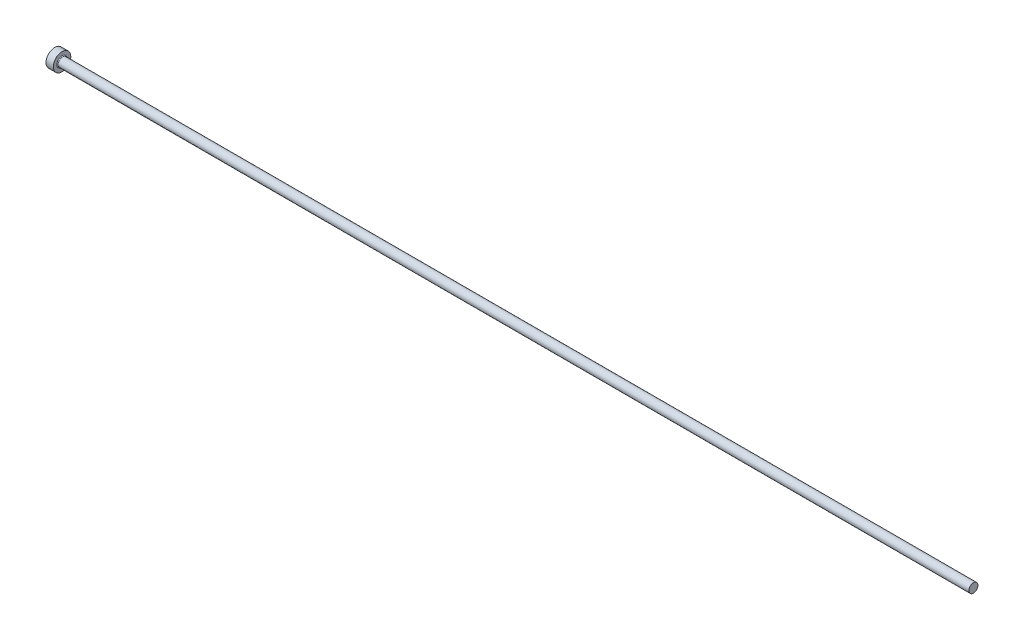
ISO-10303-21;
HEADER;
FILE_DESCRIPTION(('STEP AP214'),'2;1');
FILE_NAME('part.step','',(''),(''),'','','');
FILE_SCHEMA(('AUTOMOTIVE_DESIGN { 1 0 10303 214 1 1 1 1 }'));
ENDSEC;
DATA;
#1=APPLICATION_CONTEXT('core data for automotive mechanical design processes');
#2=APPLICATION_PROTOCOL_DEFINITION('international standard','automotive_design',2000,#1);
#3=PRODUCT_CONTEXT('',#1,'mechanical');
#4=PRODUCT('Part','Part','',(#3));
#5=PRODUCT_RELATED_PRODUCT_CATEGORY('part','',(#4));
#6=PRODUCT_DEFINITION_FORMATION('','',#4);
#7=PRODUCT_DEFINITION_CONTEXT('part definition',#1,'design');
#8=PRODUCT_DEFINITION('design','',#6,#7);
#9=PRODUCT_DEFINITION_SHAPE('','',#8);
#10=(LENGTH_UNIT() NAMED_UNIT(*) SI_UNIT(.MILLI.,.METRE.));
#11=(NAMED_UNIT(*) PLANE_ANGLE_UNIT() SI_UNIT($,.RADIAN.));
#12=(NAMED_UNIT(*) SI_UNIT($,.STERADIAN.) SOLID_ANGLE_UNIT());
#13=UNCERTAINTY_MEASURE_WITH_UNIT(LENGTH_MEASURE(1.E-05),#10,'distance_accuracy_value','');
#14=(GEOMETRIC_REPRESENTATION_CONTEXT(3) GLOBAL_UNCERTAINTY_ASSIGNED_CONTEXT((#13)) GLOBAL_UNIT_ASSIGNED_CONTEXT((#10,
#11,#12)) REPRESENTATION_CONTEXT('',''));
#15=CARTESIAN_POINT('',(0.,0.,0.));
#16=DIRECTION('',(0.,0.,1.));
#17=DIRECTION('',(1.,0.,0.));
#18=AXIS2_PLACEMENT_3D('',#15,#16,#17);
#19=CARTESIAN_POINT('',(0.,0.,0.));
#20=DIRECTION('',(-1.,0.,0.));
#21=DIRECTION('',(0.,-1.,0.));
#22=AXIS2_PLACEMENT_3D('',#19,#20,#21);
#23=PLANE('',#22);
#24=CARTESIAN_POINT('',(0.,0.,0.));
#25=DIRECTION('',(1.,0.,0.));
#26=DIRECTION('',(0.,1.,0.));
#27=AXIS2_PLACEMENT_3D('',#24,#25,#26);
#28=CIRCLE('',#27,6.);
#29=CARTESIAN_POINT('',(0.,6.,0.));
#30=VERTEX_POINT('',#29);
#31=EDGE_CURVE('E25',#30,#30,#28,.T.);
#32=ORIENTED_EDGE('',*,*,#31,.F.);
#33=EDGE_LOOP('',(#32));
#34=FACE_BOUND('',#33,.T.);
#35=ADVANCED_FACE('F14',(#34),#23,.T.);
#36=CARTESIAN_POINT('',(630.,0.,0.));
#37=DIRECTION('',(1.,0.,0.));
#38=DIRECTION('',(0.,1.,0.));
#39=AXIS2_PLACEMENT_3D('',#36,#37,#38);
#40=CYLINDRICAL_SURFACE('',#39,6.);
#41=ORIENTED_EDGE('',*,*,#31,.T.);
#42=EDGE_LOOP('',(#41));
#43=FACE_BOUND('',#42,.T.);
#44=CARTESIAN_POINT('',(5.,0.,0.));
#45=DIRECTION('',(1.,0.,0.));
#46=DIRECTION('',(0.,1.,0.));
#47=AXIS2_PLACEMENT_3D('',#44,#45,#46);
#48=CIRCLE('',#47,6.);
#49=CARTESIAN_POINT('',(5.,6.,0.));
#50=VERTEX_POINT('',#49);
#51=EDGE_CURVE('E29',#50,#50,#48,.T.);
#52=ORIENTED_EDGE('',*,*,#51,.F.);
#53=EDGE_LOOP('',(#52));
#54=FACE_BOUND('',#53,.T.);
#55=ADVANCED_FACE('F51',(#43,#54),#40,.T.);
#56=CARTESIAN_POINT('',(5.,6.,0.));
#57=DIRECTION('',(1.,0.,0.));
#58=DIRECTION('',(0.,1.,0.));
#59=AXIS2_PLACEMENT_3D('',#56,#57,#58);
#60=PLANE('',#59);
#61=CARTESIAN_POINT('',(5.,0.,0.));
#62=DIRECTION('',(1.,0.,0.));
#63=DIRECTION('',(0.,1.,0.));
#64=AXIS2_PLACEMENT_3D('',#61,#62,#63);
#65=CIRCLE('',#64,3.59999999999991);
#66=CARTESIAN_POINT('',(5.,3.59999999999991,0.));
#67=VERTEX_POINT('',#66);
#68=EDGE_CURVE('E9',#67,#67,#65,.F.);
#69=ORIENTED_EDGE('',*,*,#68,.T.);
#70=EDGE_LOOP('',(#69));
#71=FACE_BOUND('',#70,.T.);
#72=ORIENTED_EDGE('',*,*,#51,.T.);
#73=EDGE_LOOP('',(#72));
#74=FACE_BOUND('',#73,.T.);
#75=ADVANCED_FACE('F42',(#71,#74),#60,.T.);
#76=CARTESIAN_POINT('',(630.,0.,0.));
#77=DIRECTION('',(1.,0.,0.));
#78=DIRECTION('',(0.,1.,0.));
#79=AXIS2_PLACEMENT_3D('',#76,#77,#78);
#80=CYLINDRICAL_SURFACE('',#79,3.09999999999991);
#81=CARTESIAN_POINT('',(5.5,0.,0.));
#82=DIRECTION('',(1.,0.,0.));
#83=DIRECTION('',(0.,1.,0.));
#84=AXIS2_PLACEMENT_3D('',#81,#82,#83);
#85=CIRCLE('',#84,3.09999999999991);
#86=CARTESIAN_POINT('',(5.5,3.09999999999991,0.));
#87=VERTEX_POINT('',#86);
#88=EDGE_CURVE('E21',#87,#87,#85,.T.);
#89=ORIENTED_EDGE('',*,*,#88,.T.);
#90=EDGE_LOOP('',(#89));
#91=FACE_BOUND('',#90,.T.);
#92=CARTESIAN_POINT('',(630.,0.,0.));
#93=DIRECTION('',(1.,0.,0.));
#94=DIRECTION('',(0.,1.,0.));
#95=AXIS2_PLACEMENT_3D('',#92,#93,#94);
#96=CIRCLE('',#95,3.09999999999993);
#97=CARTESIAN_POINT('',(630.,3.09999999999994,0.));
#98=VERTEX_POINT('',#97);
#99=EDGE_CURVE('E34',#98,#98,#96,.T.);
#100=ORIENTED_EDGE('',*,*,#99,.F.);
#101=EDGE_LOOP('',(#100));
#102=FACE_BOUND('',#101,.T.);
#103=ADVANCED_FACE('F40',(#91,#102),#80,.T.);
#104=CARTESIAN_POINT('',(630.,3.09999999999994,0.));
#105=DIRECTION('',(1.,0.,0.));
#106=DIRECTION('',(0.,1.,0.));
#107=AXIS2_PLACEMENT_3D('',#104,#105,#106);
#108=PLANE('',#107);
#109=ORIENTED_EDGE('',*,*,#99,.T.);
#110=EDGE_LOOP('',(#109));
#111=FACE_BOUND('',#110,.T.);
#112=ADVANCED_FACE('F38',(#111),#108,.T.);
#113=CARTESIAN_POINT('',(5.5,0.,0.));
#114=DIRECTION('',(1.,0.,0.));
#115=DIRECTION('',(0.,1.,0.));
#116=AXIS2_PLACEMENT_3D('',#113,#114,#115);
#117=TOROIDAL_SURFACE('',#116,3.59999999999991,0.5);
#118=ORIENTED_EDGE('',*,*,#68,.F.);
#119=EDGE_LOOP('',(#118));
#120=FACE_BOUND('',#119,.T.);
#121=ORIENTED_EDGE('',*,*,#88,.F.);
#122=EDGE_LOOP('',(#121));
#123=FACE_BOUND('',#122,.T.);
#124=ADVANCED_FACE('F16',(#120,#123),#117,.F.);
#125=CLOSED_SHELL('',(#35,#55,#75,#103,#112,#124));
#126=MANIFOLD_SOLID_BREP('B1',#125);
#127=ADVANCED_BREP_SHAPE_REPRESENTATION('',(#18,#126),#14);
#128=SHAPE_DEFINITION_REPRESENTATION(#9,#127);
ENDSEC;
END-ISO-10303-21;
